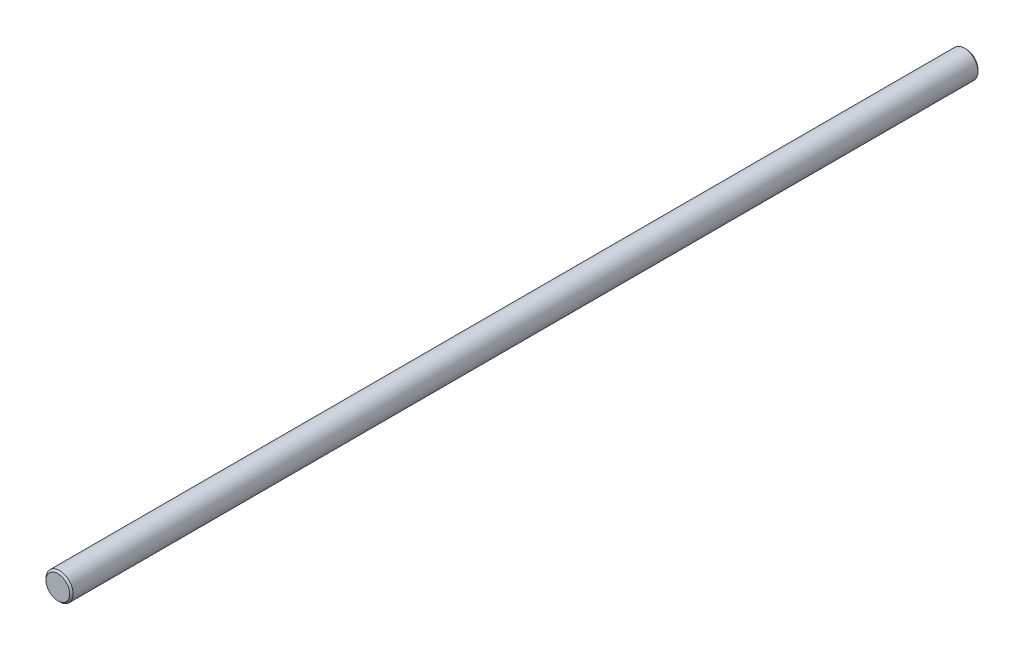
from build123d import *

# Parameters (mm, degrees)
SKETCH_1_R      = 4
EXTRUDE_1_DEPTH = 268
CHAMFER_1_SIZE  = 0.5


with BuildPart() as part:
    # Sketch 1 → Extrude 1 (new body)
    with BuildSketch(Plane(origin=(0, 0, -267), x_dir=(-1, 0, 0), z_dir=(0, 0, -1))):
        with Locations(Location((0, 0, 0), (0, 0, 180))):
            Circle(SKETCH_1_R)
    extrude(amount=-EXTRUDE_1_DEPTH)

    # Chamfer 1
    chamfer_1_edges = [part.edges().sort_by_distance(p)[0] for p in [
        (-4, 0, -267),
        (-4, 0, 1),
    ]]
    chamfer(chamfer_1_edges, length=CHAMFER_1_SIZE)


solid = part.part
